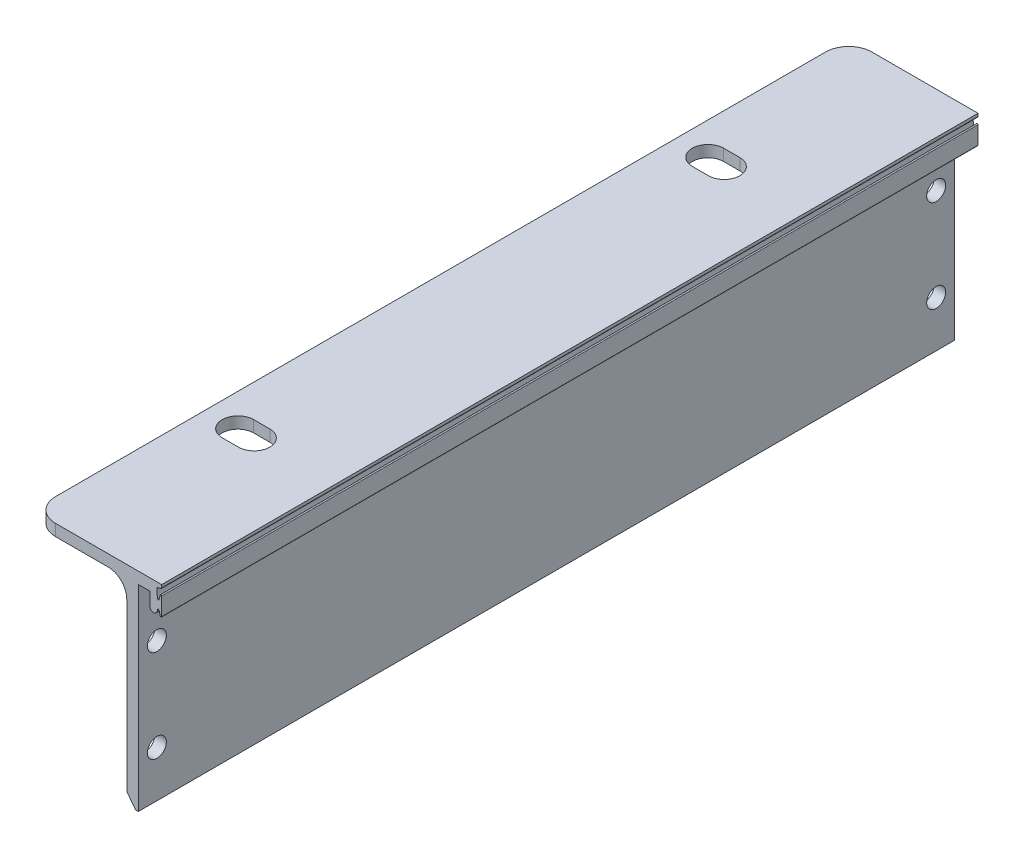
from build123d import *

# Parameters (mm, degrees)
EXTRUDE_1_DEPTH     = 88.225
SKETCH_8_R          = 2.05
CUT_EXTRUDE_7_DEPTH = 132
CUT_EXTRUDE_2_DEPTH = 132
FILLET_1_R          = 5


with BuildPart() as part:
    # Sketch 1 → Extrude 1 (new, symmetric)
    with BuildSketch(Plane.XY):
        with BuildLine():
            ThreePointArc((2132.435090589, -3070.271459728), (2131.263517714, -3067.443032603), (2128.435090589, -3066.271459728))
            Line((2128.435090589, -3066.271459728), (2112.035090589, -3066.271459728))
            Line((2112.035090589, -3066.271459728), (2112.035090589, -3063.771459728))
            Line((2112.035090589, -3063.771459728), (2139.975090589, -3063.771459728))
            Line((2139.975090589, -3063.771459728), (2139.975090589, -3064.346124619))
            ThreePointArc((2139.975090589, -3064.346124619), (2139.903546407, -3064.540567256), (2139.723037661, -3064.642268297))
            Line((2139.723037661, -3064.642268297), (2139.173958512, -3064.731166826))
            ThreePointArc((2139.173958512, -3064.731166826), (2138.997398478, -3064.828321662), (2138.922147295, -3065.015270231))
            ThreePointArc((2138.922147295, -3065.015270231), (2138.952145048, -3065.946640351), (2139.116114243, -3066.863953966))
            ThreePointArc((2139.116114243, -3066.863953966), (2139.255686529, -3066.99616465), (2139.410706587, -3066.882459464))
            Line((2139.410706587, -3066.882459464), (2139.654839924, -3065.894960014))
            ThreePointArc((2139.654839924, -3065.894960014), (2139.832234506, -3065.772651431), (2139.975090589, -3065.933959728))
            Line((2139.975090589, -3065.933959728), (2139.975090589, -3069.758959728))
            ThreePointArc((2139.975090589, -3069.758959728), (2139.832234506, -3069.920268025), (2139.654839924, -3069.797959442))
            Line((2139.654839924, -3069.797959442), (2139.410706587, -3068.810459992))
            ThreePointArc((2139.410706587, -3068.810459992), (2139.266756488, -3068.696468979), (2139.120310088, -3068.807234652))
            Line((2139.120310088, -3068.807234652), (2138.975240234, -3069.342690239))
            ThreePointArc((2138.975240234, -3069.342690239), (2138.115427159, -3069.91461219), (2137.435090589, -3069.137749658))
            Line((2137.435090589, -3069.137749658), (2137.435090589, -3066.271459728))
            Line((2137.435090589, -3066.271459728), (2134.935090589, -3066.271459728))
            Line((2134.935090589, -3066.271459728), (2134.935090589, -3108.771459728))
            Line((2134.935090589, -3108.771459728), (2134.335090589, -3108.771459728))
            Line((2134.335090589, -3108.771459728), (2132.435090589, -3106.271459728))
            Line((2132.435090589, -3106.271459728), (2132.435090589, -3070.271459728))
        make_face()
    extrude(amount=EXTRUDE_1_DEPTH, both=True)

    # Sketch 8 → Cut-Extrude 7 (cut)
    with BuildSketch(Plane.ZY.offset(-2132.435090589)):
        with Locations(Location((-84.225, -3078.771459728, 0), (0, 0, 270))):
            Circle(SKETCH_8_R)
        with Locations(Location((-84.225, -3098.771459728, 0), (0, 0, 270))):
            Circle(SKETCH_8_R)
        with Locations(Location((84.225, -3098.771459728, 0), (0, 0, 90))):
            Circle(SKETCH_8_R)
        with Locations(Location((84.225, -3078.771459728, 0), (0, 0, 90))):
            Circle(SKETCH_8_R)
    extrude(amount=-CUT_EXTRUDE_7_DEPTH, mode=Mode.SUBTRACT)

    # Sketch 4 → Cut-Extrude 2 (cut)
    with BuildSketch(Plane(origin=(0, -3063.771459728, 0), x_dir=(1, 0, 0), z_dir=(0, 1, 0))):
        with BuildLine():
            Line((2119.035090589, 54.2), (2122.535090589, 54.2))
            ThreePointArc((2122.535090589, 54.2), (2125.935090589, 50.8), (2122.535090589, 47.4))
            Line((2122.535090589, 47.4), (2119.035090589, 47.4))
            ThreePointArc((2119.035090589, 47.4), (2115.635090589, 50.8), (2119.035090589, 54.2))
        make_face()
        with BuildLine():
            Line((2119.035090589, -54.2), (2122.535090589, -54.2))
            ThreePointArc((2122.535090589, -54.2), (2125.935090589, -50.8), (2122.535090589, -47.4))
            Line((2122.535090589, -47.4), (2119.035090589, -47.4))
            ThreePointArc((2119.035090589, -47.4), (2115.635090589, -50.8), (2119.035090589, -54.2))
        make_face()
    extrude(amount=-CUT_EXTRUDE_2_DEPTH, mode=Mode.SUBTRACT)

    # Fillet 1
    fillet_1_edges = [part.edges().sort_by_distance(p)[0] for p in [
        (2112.035090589, -3065.021459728, 88.225),
        (2112.035090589, -3065.021459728, -88.225),
    ]]
    fillet(fillet_1_edges, radius=FILLET_1_R)


solid = part.part
